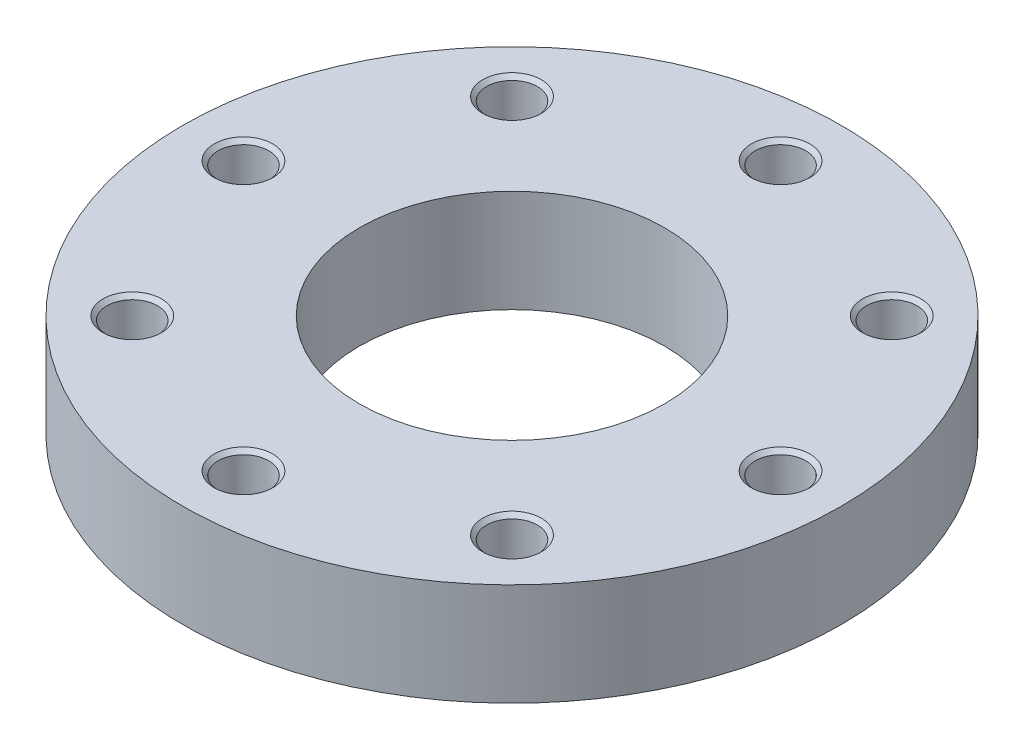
ISO-10303-21;
HEADER;
FILE_DESCRIPTION(('STEP AP214'),'2;1');
FILE_NAME('part.step','',(''),(''),'','','');
FILE_SCHEMA(('AUTOMOTIVE_DESIGN { 1 0 10303 214 1 1 1 1 }'));
ENDSEC;
DATA;
#1=APPLICATION_CONTEXT('core data for automotive mechanical design processes');
#2=APPLICATION_PROTOCOL_DEFINITION('international standard','automotive_design',2000,#1);
#3=PRODUCT_CONTEXT('',#1,'mechanical');
#4=PRODUCT('Part','Part','',(#3));
#5=PRODUCT_RELATED_PRODUCT_CATEGORY('part','',(#4));
#6=PRODUCT_DEFINITION_FORMATION('','',#4);
#7=PRODUCT_DEFINITION_CONTEXT('part definition',#1,'design');
#8=PRODUCT_DEFINITION('design','',#6,#7);
#9=PRODUCT_DEFINITION_SHAPE('','',#8);
#10=(LENGTH_UNIT() NAMED_UNIT(*) SI_UNIT(.MILLI.,.METRE.));
#11=(NAMED_UNIT(*) PLANE_ANGLE_UNIT() SI_UNIT($,.RADIAN.));
#12=(NAMED_UNIT(*) SI_UNIT($,.STERADIAN.) SOLID_ANGLE_UNIT());
#13=UNCERTAINTY_MEASURE_WITH_UNIT(LENGTH_MEASURE(1.E-05),#10,'distance_accuracy_value','');
#14=(GEOMETRIC_REPRESENTATION_CONTEXT(3) GLOBAL_UNCERTAINTY_ASSIGNED_CONTEXT((#13)) GLOBAL_UNIT_ASSIGNED_CONTEXT((#10,
#11,#12)) REPRESENTATION_CONTEXT('',''));
#15=CARTESIAN_POINT('',(0.,0.,0.));
#16=DIRECTION('',(0.,0.,1.));
#17=DIRECTION('',(1.,0.,0.));
#18=AXIS2_PLACEMENT_3D('',#15,#16,#17);
#19=CARTESIAN_POINT('',(0.,21.,0.));
#20=DIRECTION('',(0.,-1.,0.));
#21=DIRECTION('',(1.,0.,0.));
#22=AXIS2_PLACEMENT_3D('',#19,#20,#21);
#23=CYLINDRICAL_SURFACE('',#22,135.);
#24=CARTESIAN_POINT('',(0.,0.,0.));
#25=DIRECTION('',(0.,1.,0.));
#26=DIRECTION('',(1.,0.,0.));
#27=AXIS2_PLACEMENT_3D('',#24,#25,#26);
#28=CIRCLE('',#27,135.);
#29=CARTESIAN_POINT('',(135.,0.,0.));
#30=VERTEX_POINT('',#29);
#31=EDGE_CURVE('E9',#30,#30,#28,.T.);
#32=ORIENTED_EDGE('',*,*,#31,.T.);
#33=EDGE_LOOP('',(#32));
#34=FACE_BOUND('',#33,.T.);
#35=CARTESIAN_POINT('',(0.,42.,0.));
#36=DIRECTION('',(0.,1.,0.));
#37=DIRECTION('',(1.,0.,0.));
#38=AXIS2_PLACEMENT_3D('',#35,#36,#37);
#39=CIRCLE('',#38,135.);
#40=CARTESIAN_POINT('',(135.,42.,0.));
#41=VERTEX_POINT('',#40);
#42=EDGE_CURVE('E254',#41,#41,#39,.T.);
#43=ORIENTED_EDGE('',*,*,#42,.F.);
#44=EDGE_LOOP('',(#43));
#45=FACE_BOUND('',#44,.T.);
#46=ADVANCED_FACE('F15',(#34,#45),#23,.T.);
#47=CARTESIAN_POINT('',(98.75,0.,0.));
#48=DIRECTION('',(0.,-1.,0.));
#49=DIRECTION('',(-1.,0.,0.));
#50=AXIS2_PLACEMENT_3D('',#47,#48,#49);
#51=PLANE('',#50);
#52=CARTESIAN_POINT('',(0.,0.,0.));
#53=DIRECTION('',(0.,1.,0.));
#54=DIRECTION('',(1.,0.,0.));
#55=AXIS2_PLACEMENT_3D('',#52,#53,#54);
#56=CIRCLE('',#55,62.5);
#57=CARTESIAN_POINT('',(62.5,0.,0.));
#58=VERTEX_POINT('',#57);
#59=EDGE_CURVE('E25',#58,#58,#56,.T.);
#60=ORIENTED_EDGE('',*,*,#59,.T.);
#61=EDGE_LOOP('',(#60));
#62=FACE_BOUND('',#61,.T.);
#63=ORIENTED_EDGE('',*,*,#31,.F.);
#64=EDGE_LOOP('',(#63));
#65=FACE_BOUND('',#64,.T.);
#66=ADVANCED_FACE('F361',(#62,#65),#51,.T.);
#67=CARTESIAN_POINT('',(0.,21.,0.));
#68=DIRECTION('',(0.,-1.,0.));
#69=DIRECTION('',(1.,0.,0.));
#70=AXIS2_PLACEMENT_3D('',#67,#68,#69);
#71=CYLINDRICAL_SURFACE('',#70,62.5);
#72=CARTESIAN_POINT('',(0.,42.,0.));
#73=DIRECTION('',(0.,1.,0.));
#74=DIRECTION('',(1.,0.,0.));
#75=AXIS2_PLACEMENT_3D('',#72,#73,#74);
#76=CIRCLE('',#75,62.5);
#77=CARTESIAN_POINT('',(62.5,42.,0.));
#78=VERTEX_POINT('',#77);
#79=EDGE_CURVE('E282',#78,#78,#76,.T.);
#80=ORIENTED_EDGE('',*,*,#79,.T.);
#81=EDGE_LOOP('',(#80));
#82=FACE_BOUND('',#81,.T.);
#83=ORIENTED_EDGE('',*,*,#59,.F.);
#84=EDGE_LOOP('',(#83));
#85=FACE_BOUND('',#84,.T.);
#86=ADVANCED_FACE('F366',(#82,#85),#71,.F.);
#87=CARTESIAN_POINT('',(98.75,42.,0.));
#88=DIRECTION('',(0.,1.,0.));
#89=DIRECTION('',(1.,0.,0.));
#90=AXIS2_PLACEMENT_3D('',#87,#88,#89);
#91=PLANE('',#90);
#92=ORIENTED_EDGE('',*,*,#42,.T.);
#93=EDGE_LOOP('',(#92));
#94=FACE_BOUND('',#93,.T.);
#95=ORIENTED_EDGE('',*,*,#79,.F.);
#96=EDGE_LOOP('',(#95));
#97=FACE_BOUND('',#96,.T.);
#98=CARTESIAN_POINT('',(110.,42.,0.));
#99=DIRECTION('',(0.,-1.,0.));
#100=DIRECTION('',(1.,0.,0.));
#101=AXIS2_PLACEMENT_3D('',#98,#99,#100);
#102=CIRCLE('',#101,12.);
#103=CARTESIAN_POINT('',(122.,42.,0.));
#104=VERTEX_POINT('',#103);
#105=EDGE_CURVE('E203',#104,#104,#102,.T.);
#106=ORIENTED_EDGE('',*,*,#105,.T.);
#107=EDGE_LOOP('',(#106));
#108=FACE_BOUND('',#107,.T.);
#109=CARTESIAN_POINT('',(77.7817459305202,42.,-77.7817459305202));
#110=DIRECTION('',(0.,-1.,0.));
#111=DIRECTION('',(0.707106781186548,0.,-0.707106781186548));
#112=AXIS2_PLACEMENT_3D('',#109,#110,#111);
#113=CIRCLE('',#112,12.);
#114=CARTESIAN_POINT('',(86.2670273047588,42.,-86.2670273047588));
#115=VERTEX_POINT('',#114);
#116=EDGE_CURVE('E257',#115,#115,#113,.T.);
#117=ORIENTED_EDGE('',*,*,#116,.T.);
#118=EDGE_LOOP('',(#117));
#119=FACE_BOUND('',#118,.T.);
#120=CARTESIAN_POINT('',(0.,42.,-110.));
#121=DIRECTION('',(0.,-1.,0.));
#122=DIRECTION('',(0.,0.,-1.));
#123=AXIS2_PLACEMENT_3D('',#120,#121,#122);
#124=CIRCLE('',#123,12.);
#125=CARTESIAN_POINT('',(0.,42.,-122.));
#126=VERTEX_POINT('',#125);
#127=EDGE_CURVE('E211',#126,#126,#124,.T.);
#128=ORIENTED_EDGE('',*,*,#127,.T.);
#129=EDGE_LOOP('',(#128));
#130=FACE_BOUND('',#129,.T.);
#131=CARTESIAN_POINT('',(-77.7817459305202,42.,-77.7817459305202));
#132=DIRECTION('',(0.,-1.,0.));
#133=DIRECTION('',(-0.707106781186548,0.,-0.707106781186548));
#134=AXIS2_PLACEMENT_3D('',#131,#132,#133);
#135=CIRCLE('',#134,12.);
#136=CARTESIAN_POINT('',(-86.2670273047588,42.,-86.2670273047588));
#137=VERTEX_POINT('',#136);
#138=EDGE_CURVE('E180',#137,#137,#135,.T.);
#139=ORIENTED_EDGE('',*,*,#138,.T.);
#140=EDGE_LOOP('',(#139));
#141=FACE_BOUND('',#140,.T.);
#142=CARTESIAN_POINT('',(-110.,42.,0.));
#143=DIRECTION('',(0.,-1.,0.));
#144=DIRECTION('',(-1.,0.,0.));
#145=AXIS2_PLACEMENT_3D('',#142,#143,#144);
#146=CIRCLE('',#145,12.);
#147=CARTESIAN_POINT('',(-122.,42.,0.));
#148=VERTEX_POINT('',#147);
#149=EDGE_CURVE('E198',#148,#148,#146,.T.);
#150=ORIENTED_EDGE('',*,*,#149,.T.);
#151=EDGE_LOOP('',(#150));
#152=FACE_BOUND('',#151,.T.);
#153=CARTESIAN_POINT('',(-77.7817459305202,42.,77.7817459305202));
#154=DIRECTION('',(0.,-1.,0.));
#155=DIRECTION('',(-0.707106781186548,0.,0.707106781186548));
#156=AXIS2_PLACEMENT_3D('',#153,#154,#155);
#157=CIRCLE('',#156,12.);
#158=CARTESIAN_POINT('',(-86.2670273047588,42.,86.2670273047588));
#159=VERTEX_POINT('',#158);
#160=EDGE_CURVE('E271',#159,#159,#157,.T.);
#161=ORIENTED_EDGE('',*,*,#160,.T.);
#162=EDGE_LOOP('',(#161));
#163=FACE_BOUND('',#162,.T.);
#164=CARTESIAN_POINT('',(0.,42.,110.));
#165=DIRECTION('',(0.,-1.,0.));
#166=DIRECTION('',(0.,0.,1.));
#167=AXIS2_PLACEMENT_3D('',#164,#165,#166);
#168=CIRCLE('',#167,12.);
#169=CARTESIAN_POINT('',(0.,42.,122.));
#170=VERTEX_POINT('',#169);
#171=EDGE_CURVE('E200',#170,#170,#168,.T.);
#172=ORIENTED_EDGE('',*,*,#171,.T.);
#173=EDGE_LOOP('',(#172));
#174=FACE_BOUND('',#173,.T.);
#175=CARTESIAN_POINT('',(77.7817459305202,42.,77.7817459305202));
#176=DIRECTION('',(0.,-1.,0.));
#177=DIRECTION('',(0.707106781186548,0.,0.707106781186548));
#178=AXIS2_PLACEMENT_3D('',#175,#176,#177);
#179=CIRCLE('',#178,12.);
#180=CARTESIAN_POINT('',(86.2670273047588,42.,86.2670273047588));
#181=VERTEX_POINT('',#180);
#182=EDGE_CURVE('E250',#181,#181,#179,.T.);
#183=ORIENTED_EDGE('',*,*,#182,.T.);
#184=EDGE_LOOP('',(#183));
#185=FACE_BOUND('',#184,.T.);
#186=ADVANCED_FACE('F428',(#94,#97,#108,#119,#130,#141,#152,#163,#174,#185),#91,.T.);
#187=CARTESIAN_POINT('',(110.,6.00463463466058,0.));
#188=DIRECTION('',(0.,1.,0.));
#189=DIRECTION('',(1.,0.,0.));
#190=AXIS2_PLACEMENT_3D('',#187,#188,#189);
#191=CONICAL_SURFACE('',#190,5.188125,1.0471975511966);
#192=CARTESIAN_POINT('',(110.,9.,0.));
#193=DIRECTION('',(0.,-1.,0.));
#194=DIRECTION('',(1.,0.,0.));
#195=AXIS2_PLACEMENT_3D('',#192,#193,#194);
#196=CIRCLE('',#195,10.37625);
#197=CARTESIAN_POINT('',(120.37625,9.,0.));
#198=VERTEX_POINT('',#197);
#199=EDGE_CURVE('E19',#198,#198,#196,.T.);
#200=ORIENTED_EDGE('',*,*,#199,.F.);
#201=EDGE_LOOP('',(#200));
#202=FACE_BOUND('',#201,.T.);
#203=CARTESIAN_POINT('',(110.,3.00926926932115,0.));
#204=VERTEX_POINT('',#203);
#205=VERTEX_LOOP('',#204);
#206=FACE_BOUND('',#205,.T.);
#207=ADVANCED_FACE('F462',(#202,#206),#191,.F.);
#208=CARTESIAN_POINT('',(110.,12.688125,0.));
#209=DIRECTION('',(0.,1.,0.));
#210=DIRECTION('',(1.,0.,0.));
#211=AXIS2_PLACEMENT_3D('',#208,#209,#210);
#212=CYLINDRICAL_SURFACE('',#211,10.37625);
#213=CARTESIAN_POINT('',(110.,16.37625,0.));
#214=DIRECTION('',(0.,-1.,0.));
#215=DIRECTION('',(1.,0.,0.));
#216=AXIS2_PLACEMENT_3D('',#213,#214,#215);
#217=CIRCLE('',#216,10.37625);
#218=CARTESIAN_POINT('',(120.37625,16.37625,0.));
#219=VERTEX_POINT('',#218);
#220=EDGE_CURVE('E192',#219,#219,#217,.T.);
#221=ORIENTED_EDGE('',*,*,#220,.F.);
#222=EDGE_LOOP('',(#221));
#223=FACE_BOUND('',#222,.T.);
#224=ORIENTED_EDGE('',*,*,#199,.T.);
#225=EDGE_LOOP('',(#224));
#226=FACE_BOUND('',#225,.T.);
#227=ADVANCED_FACE('F460',(#223,#226),#212,.F.);
#228=CARTESIAN_POINT('',(110.,17.188125,0.));
#229=DIRECTION('',(0.,1.,0.));
#230=DIRECTION('',(1.,0.,0.));
#231=AXIS2_PLACEMENT_3D('',#228,#229,#230);
#232=CONICAL_SURFACE('',#231,11.188125,0.785398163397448);
#233=CARTESIAN_POINT('',(110.,18.,0.));
#234=DIRECTION('',(0.,-1.,0.));
#235=DIRECTION('',(1.,0.,0.));
#236=AXIS2_PLACEMENT_3D('',#233,#234,#235);
#237=CIRCLE('',#236,12.);
#238=CARTESIAN_POINT('',(122.,18.,0.));
#239=VERTEX_POINT('',#238);
#240=EDGE_CURVE('E194',#239,#239,#237,.T.);
#241=ORIENTED_EDGE('',*,*,#240,.F.);
#242=EDGE_LOOP('',(#241));
#243=FACE_BOUND('',#242,.T.);
#244=ORIENTED_EDGE('',*,*,#220,.T.);
#245=EDGE_LOOP('',(#244));
#246=FACE_BOUND('',#245,.T.);
#247=ADVANCED_FACE('F394',(#243,#246),#232,.F.);
#248=CARTESIAN_POINT('',(121.188125,18.,0.));
#249=DIRECTION('',(0.,1.,0.));
#250=DIRECTION('',(-1.,0.,0.));
#251=AXIS2_PLACEMENT_3D('',#248,#249,#250);
#252=PLANE('',#251);
#253=CARTESIAN_POINT('',(110.,18.,0.));
#254=DIRECTION('',(0.,-1.,0.));
#255=DIRECTION('',(1.,0.,0.));
#256=AXIS2_PLACEMENT_3D('',#253,#254,#255);
#257=CIRCLE('',#256,10.37625);
#258=CARTESIAN_POINT('',(120.37625,18.,0.));
#259=VERTEX_POINT('',#258);
#260=EDGE_CURVE('E206',#259,#259,#257,.T.);
#261=ORIENTED_EDGE('',*,*,#260,.F.);
#262=EDGE_LOOP('',(#261));
#263=FACE_BOUND('',#262,.T.);
#264=ORIENTED_EDGE('',*,*,#240,.T.);
#265=EDGE_LOOP('',(#264));
#266=FACE_BOUND('',#265,.T.);
#267=ADVANCED_FACE('F390',(#263,#266),#252,.F.);
#268=CARTESIAN_POINT('',(110.,29.188125,0.));
#269=DIRECTION('',(0.,1.,0.));
#270=DIRECTION('',(1.,0.,0.));
#271=AXIS2_PLACEMENT_3D('',#268,#269,#270);
#272=CYLINDRICAL_SURFACE('',#271,10.37625);
#273=CARTESIAN_POINT('',(110.,40.37625,0.));
#274=DIRECTION('',(0.,-1.,0.));
#275=DIRECTION('',(1.,0.,0.));
#276=AXIS2_PLACEMENT_3D('',#273,#274,#275);
#277=CIRCLE('',#276,10.37625);
#278=CARTESIAN_POINT('',(120.37625,40.37625,0.));
#279=VERTEX_POINT('',#278);
#280=EDGE_CURVE('E207',#279,#279,#277,.T.);
#281=ORIENTED_EDGE('',*,*,#280,.F.);
#282=EDGE_LOOP('',(#281));
#283=FACE_BOUND('',#282,.T.);
#284=ORIENTED_EDGE('',*,*,#260,.T.);
#285=EDGE_LOOP('',(#284));
#286=FACE_BOUND('',#285,.T.);
#287=ADVANCED_FACE('F393',(#283,#286),#272,.F.);
#288=CARTESIAN_POINT('',(110.,41.188125,0.));
#289=DIRECTION('',(0.,1.,0.));
#290=DIRECTION('',(1.,0.,0.));
#291=AXIS2_PLACEMENT_3D('',#288,#289,#290);
#292=CONICAL_SURFACE('',#291,11.188125,0.785398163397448);
#293=ORIENTED_EDGE('',*,*,#105,.F.);
#294=EDGE_LOOP('',(#293));
#295=FACE_BOUND('',#294,.T.);
#296=ORIENTED_EDGE('',*,*,#280,.T.);
#297=EDGE_LOOP('',(#296));
#298=FACE_BOUND('',#297,.T.);
#299=ADVANCED_FACE('F483',(#295,#298),#292,.F.);
#300=CARTESIAN_POINT('',(77.7817459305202,6.00463463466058,-77.7817459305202));
#301=DIRECTION('',(0.,1.,0.));
#302=DIRECTION('',(0.707106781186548,0.,-0.707106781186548));
#303=AXIS2_PLACEMENT_3D('',#300,#301,#302);
#304=CONICAL_SURFACE('',#303,5.188125,1.0471975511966);
#305=CARTESIAN_POINT('',(77.7817459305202,9.,-77.7817459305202));
#306=DIRECTION('',(0.,-1.,0.));
#307=DIRECTION('',(0.707106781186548,0.,-0.707106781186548));
#308=AXIS2_PLACEMENT_3D('',#305,#306,#307);
#309=CIRCLE('',#308,10.37625);
#310=CARTESIAN_POINT('',(85.1188626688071,9.,-85.1188626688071));
#311=VERTEX_POINT('',#310);
#312=EDGE_CURVE('E237',#311,#311,#309,.T.);
#313=ORIENTED_EDGE('',*,*,#312,.F.);
#314=EDGE_LOOP('',(#313));
#315=FACE_BOUND('',#314,.T.);
#316=CARTESIAN_POINT('',(77.7817459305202,3.00926926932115,-77.7817459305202));
#317=VERTEX_POINT('',#316);
#318=VERTEX_LOOP('',#317);
#319=FACE_BOUND('',#318,.T.);
#320=ADVANCED_FACE('F480',(#315,#319),#304,.F.);
#321=CARTESIAN_POINT('',(77.7817459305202,12.688125,-77.7817459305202));
#322=DIRECTION('',(0.,1.,0.));
#323=DIRECTION('',(0.707106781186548,0.,-0.707106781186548));
#324=AXIS2_PLACEMENT_3D('',#321,#322,#323);
#325=CYLINDRICAL_SURFACE('',#324,10.37625);
#326=CARTESIAN_POINT('',(77.7817459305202,16.37625,-77.7817459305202));
#327=DIRECTION('',(0.,-1.,0.));
#328=DIRECTION('',(0.707106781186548,0.,-0.707106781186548));
#329=AXIS2_PLACEMENT_3D('',#326,#327,#328);
#330=CIRCLE('',#329,10.37625);
#331=CARTESIAN_POINT('',(85.1188626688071,16.37625,-85.1188626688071));
#332=VERTEX_POINT('',#331);
#333=EDGE_CURVE('E238',#332,#332,#330,.T.);
#334=ORIENTED_EDGE('',*,*,#333,.F.);
#335=EDGE_LOOP('',(#334));
#336=FACE_BOUND('',#335,.T.);
#337=ORIENTED_EDGE('',*,*,#312,.T.);
#338=EDGE_LOOP('',(#337));
#339=FACE_BOUND('',#338,.T.);
#340=ADVANCED_FACE('F17',(#336,#339),#325,.F.);
#341=CARTESIAN_POINT('',(77.7817459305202,17.188125,-77.7817459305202));
#342=DIRECTION('',(0.,1.,0.));
#343=DIRECTION('',(0.707106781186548,0.,-0.707106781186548));
#344=AXIS2_PLACEMENT_3D('',#341,#342,#343);
#345=CONICAL_SURFACE('',#344,11.188125,0.785398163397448);
#346=CARTESIAN_POINT('',(77.7817459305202,18.,-77.7817459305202));
#347=DIRECTION('',(0.,-1.,0.));
#348=DIRECTION('',(0.707106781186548,0.,-0.707106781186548));
#349=AXIS2_PLACEMENT_3D('',#346,#347,#348);
#350=CIRCLE('',#349,12.);
#351=CARTESIAN_POINT('',(86.2670273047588,18.,-86.2670273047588));
#352=VERTEX_POINT('',#351);
#353=EDGE_CURVE('E243',#352,#352,#350,.T.);
#354=ORIENTED_EDGE('',*,*,#353,.F.);
#355=EDGE_LOOP('',(#354));
#356=FACE_BOUND('',#355,.T.);
#357=ORIENTED_EDGE('',*,*,#333,.T.);
#358=EDGE_LOOP('',(#357));
#359=FACE_BOUND('',#358,.T.);
#360=ADVANCED_FACE('F485',(#356,#359),#345,.F.);
#361=CARTESIAN_POINT('',(85.692944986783,18.,-85.692944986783));
#362=DIRECTION('',(0.,1.,0.));
#363=DIRECTION('',(-0.707106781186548,0.,0.707106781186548));
#364=AXIS2_PLACEMENT_3D('',#361,#362,#363);
#365=PLANE('',#364);
#366=CARTESIAN_POINT('',(77.7817459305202,18.,-77.7817459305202));
#367=DIRECTION('',(0.,-1.,0.));
#368=DIRECTION('',(0.707106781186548,0.,-0.707106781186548));
#369=AXIS2_PLACEMENT_3D('',#366,#367,#368);
#370=CIRCLE('',#369,10.37625);
#371=CARTESIAN_POINT('',(85.1188626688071,18.,-85.1188626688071));
#372=VERTEX_POINT('',#371);
#373=EDGE_CURVE('E247',#372,#372,#370,.T.);
#374=ORIENTED_EDGE('',*,*,#373,.F.);
#375=EDGE_LOOP('',(#374));
#376=FACE_BOUND('',#375,.T.);
#377=ORIENTED_EDGE('',*,*,#353,.T.);
#378=EDGE_LOOP('',(#377));
#379=FACE_BOUND('',#378,.T.);
#380=ADVANCED_FACE('F488',(#376,#379),#365,.F.);
#381=CARTESIAN_POINT('',(77.7817459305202,29.188125,-77.7817459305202));
#382=DIRECTION('',(0.,1.,0.));
#383=DIRECTION('',(0.707106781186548,0.,-0.707106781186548));
#384=AXIS2_PLACEMENT_3D('',#381,#382,#383);
#385=CYLINDRICAL_SURFACE('',#384,10.37625);
#386=CARTESIAN_POINT('',(77.7817459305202,40.37625,-77.7817459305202));
#387=DIRECTION('',(0.,-1.,0.));
#388=DIRECTION('',(0.707106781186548,0.,-0.707106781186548));
#389=AXIS2_PLACEMENT_3D('',#386,#387,#388);
#390=CIRCLE('',#389,10.37625);
#391=CARTESIAN_POINT('',(85.1188626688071,40.37625,-85.1188626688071));
#392=VERTEX_POINT('',#391);
#393=EDGE_CURVE('E190',#392,#392,#390,.T.);
#394=ORIENTED_EDGE('',*,*,#393,.F.);
#395=EDGE_LOOP('',(#394));
#396=FACE_BOUND('',#395,.T.);
#397=ORIENTED_EDGE('',*,*,#373,.T.);
#398=EDGE_LOOP('',(#397));
#399=FACE_BOUND('',#398,.T.);
#400=ADVANCED_FACE('F435',(#396,#399),#385,.F.);
#401=CARTESIAN_POINT('',(77.7817459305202,41.188125,-77.7817459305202));
#402=DIRECTION('',(0.,1.,0.));
#403=DIRECTION('',(0.707106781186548,0.,-0.707106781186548));
#404=AXIS2_PLACEMENT_3D('',#401,#402,#403);
#405=CONICAL_SURFACE('',#404,11.188125,0.785398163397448);
#406=ORIENTED_EDGE('',*,*,#116,.F.);
#407=EDGE_LOOP('',(#406));
#408=FACE_BOUND('',#407,.T.);
#409=ORIENTED_EDGE('',*,*,#393,.T.);
#410=EDGE_LOOP('',(#409));
#411=FACE_BOUND('',#410,.T.);
#412=ADVANCED_FACE('F431',(#408,#411),#405,.F.);
#413=CARTESIAN_POINT('',(0.,6.00463463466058,-110.));
#414=DIRECTION('',(0.,1.,0.));
#415=DIRECTION('',(0.,0.,-1.));
#416=AXIS2_PLACEMENT_3D('',#413,#414,#415);
#417=CONICAL_SURFACE('',#416,5.188125,1.0471975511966);
#418=CARTESIAN_POINT('',(0.,9.,-110.));
#419=DIRECTION('',(0.,-1.,0.));
#420=DIRECTION('',(0.,0.,-1.));
#421=AXIS2_PLACEMENT_3D('',#418,#419,#420);
#422=CIRCLE('',#421,10.37625);
#423=CARTESIAN_POINT('',(0.,9.,-120.37625));
#424=VERTEX_POINT('',#423);
#425=EDGE_CURVE('E187',#424,#424,#422,.T.);
#426=ORIENTED_EDGE('',*,*,#425,.F.);
#427=EDGE_LOOP('',(#426));
#428=FACE_BOUND('',#427,.T.);
#429=CARTESIAN_POINT('',(0.,3.00926926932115,-110.));
#430=VERTEX_POINT('',#429);
#431=VERTEX_LOOP('',#430);
#432=FACE_BOUND('',#431,.T.);
#433=ADVANCED_FACE('F434',(#428,#432),#417,.F.);
#434=CARTESIAN_POINT('',(0.,12.688125,-110.));
#435=DIRECTION('',(0.,1.,0.));
#436=DIRECTION('',(0.,0.,-1.));
#437=AXIS2_PLACEMENT_3D('',#434,#435,#436);
#438=CYLINDRICAL_SURFACE('',#437,10.37625);
#439=CARTESIAN_POINT('',(0.,16.37625,-110.));
#440=DIRECTION('',(0.,-1.,0.));
#441=DIRECTION('',(0.,0.,-1.));
#442=AXIS2_PLACEMENT_3D('',#439,#440,#441);
#443=CIRCLE('',#442,10.37625);
#444=CARTESIAN_POINT('',(0.,16.37625,-120.37625));
#445=VERTEX_POINT('',#444);
#446=EDGE_CURVE('E191',#445,#445,#443,.T.);
#447=ORIENTED_EDGE('',*,*,#446,.F.);
#448=EDGE_LOOP('',(#447));
#449=FACE_BOUND('',#448,.T.);
#450=ORIENTED_EDGE('',*,*,#425,.T.);
#451=EDGE_LOOP('',(#450));
#452=FACE_BOUND('',#451,.T.);
#453=ADVANCED_FACE('F446',(#449,#452),#438,.F.);
#454=CARTESIAN_POINT('',(0.,17.188125,-110.));
#455=DIRECTION('',(0.,1.,0.));
#456=DIRECTION('',(0.,0.,-1.));
#457=AXIS2_PLACEMENT_3D('',#454,#455,#456);
#458=CONICAL_SURFACE('',#457,11.188125,0.785398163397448);
#459=CARTESIAN_POINT('',(0.,18.,-110.));
#460=DIRECTION('',(0.,-1.,0.));
#461=DIRECTION('',(0.,0.,-1.));
#462=AXIS2_PLACEMENT_3D('',#459,#460,#461);
#463=CIRCLE('',#462,12.);
#464=CARTESIAN_POINT('',(0.,18.,-122.));
#465=VERTEX_POINT('',#464);
#466=EDGE_CURVE('E210',#465,#465,#463,.T.);
#467=ORIENTED_EDGE('',*,*,#466,.F.);
#468=EDGE_LOOP('',(#467));
#469=FACE_BOUND('',#468,.T.);
#470=ORIENTED_EDGE('',*,*,#446,.T.);
#471=EDGE_LOOP('',(#470));
#472=FACE_BOUND('',#471,.T.);
#473=ADVANCED_FACE('F449',(#469,#472),#458,.F.);
#474=CARTESIAN_POINT('',(0.,18.,-121.188125));
#475=DIRECTION('',(0.,1.,0.));
#476=DIRECTION('',(0.,0.,1.));
#477=AXIS2_PLACEMENT_3D('',#474,#475,#476);
#478=PLANE('',#477);
#479=CARTESIAN_POINT('',(0.,18.,-110.));
#480=DIRECTION('',(0.,-1.,0.));
#481=DIRECTION('',(0.,0.,-1.));
#482=AXIS2_PLACEMENT_3D('',#479,#480,#481);
#483=CIRCLE('',#482,10.37625);
#484=CARTESIAN_POINT('',(0.,18.,-120.37625));
#485=VERTEX_POINT('',#484);
#486=EDGE_CURVE('E208',#485,#485,#483,.T.);
#487=ORIENTED_EDGE('',*,*,#486,.F.);
#488=EDGE_LOOP('',(#487));
#489=FACE_BOUND('',#488,.T.);
#490=ORIENTED_EDGE('',*,*,#466,.T.);
#491=EDGE_LOOP('',(#490));
#492=FACE_BOUND('',#491,.T.);
#493=ADVANCED_FACE('F502',(#489,#492),#478,.F.);
#494=CARTESIAN_POINT('',(0.,29.188125,-110.));
#495=DIRECTION('',(0.,1.,0.));
#496=DIRECTION('',(0.,0.,-1.));
#497=AXIS2_PLACEMENT_3D('',#494,#495,#496);
#498=CYLINDRICAL_SURFACE('',#497,10.37625);
#499=CARTESIAN_POINT('',(0.,40.37625,-110.));
#500=DIRECTION('',(0.,-1.,0.));
#501=DIRECTION('',(0.,0.,-1.));
#502=AXIS2_PLACEMENT_3D('',#499,#500,#501);
#503=CIRCLE('',#502,10.37625);
#504=CARTESIAN_POINT('',(0.,40.37625,-120.37625));
#505=VERTEX_POINT('',#504);
#506=EDGE_CURVE('E265',#505,#505,#503,.T.);
#507=ORIENTED_EDGE('',*,*,#506,.F.);
#508=EDGE_LOOP('',(#507));
#509=FACE_BOUND('',#508,.T.);
#510=ORIENTED_EDGE('',*,*,#486,.T.);
#511=EDGE_LOOP('',(#510));
#512=FACE_BOUND('',#511,.T.);
#513=ADVANCED_FACE('F504',(#509,#512),#498,.F.);
#514=CARTESIAN_POINT('',(0.,41.188125,-110.));
#515=DIRECTION('',(0.,1.,0.));
#516=DIRECTION('',(0.,0.,-1.));
#517=AXIS2_PLACEMENT_3D('',#514,#515,#516);
#518=CONICAL_SURFACE('',#517,11.188125,0.785398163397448);
#519=ORIENTED_EDGE('',*,*,#127,.F.);
#520=EDGE_LOOP('',(#519));
#521=FACE_BOUND('',#520,.T.);
#522=ORIENTED_EDGE('',*,*,#506,.T.);
#523=EDGE_LOOP('',(#522));
#524=FACE_BOUND('',#523,.T.);
#525=ADVANCED_FACE('F316',(#521,#524),#518,.F.);
#526=CARTESIAN_POINT('',(-77.7817459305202,6.00463463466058,-77.7817459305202));
#527=DIRECTION('',(0.,1.,0.));
#528=DIRECTION('',(-0.707106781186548,0.,-0.707106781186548));
#529=AXIS2_PLACEMENT_3D('',#526,#527,#528);
#530=CONICAL_SURFACE('',#529,5.188125,1.0471975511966);
#531=CARTESIAN_POINT('',(-77.7817459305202,9.,-77.7817459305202));
#532=DIRECTION('',(0.,-1.,0.));
#533=DIRECTION('',(-0.707106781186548,0.,-0.707106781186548));
#534=AXIS2_PLACEMENT_3D('',#531,#532,#533);
#535=CIRCLE('',#534,10.37625);
#536=CARTESIAN_POINT('',(-85.1188626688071,9.,-85.1188626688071));
#537=VERTEX_POINT('',#536);
#538=EDGE_CURVE('E267',#537,#537,#535,.T.);
#539=ORIENTED_EDGE('',*,*,#538,.F.);
#540=EDGE_LOOP('',(#539));
#541=FACE_BOUND('',#540,.T.);
#542=CARTESIAN_POINT('',(-77.7817459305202,3.00926926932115,-77.7817459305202));
#543=VERTEX_POINT('',#542);
#544=VERTEX_LOOP('',#543);
#545=FACE_BOUND('',#544,.T.);
#546=ADVANCED_FACE('F309',(#541,#545),#530,.F.);
#547=CARTESIAN_POINT('',(-77.7817459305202,12.688125,-77.7817459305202));
#548=DIRECTION('',(0.,1.,0.));
#549=DIRECTION('',(-0.707106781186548,0.,-0.707106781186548));
#550=AXIS2_PLACEMENT_3D('',#547,#548,#549);
#551=CYLINDRICAL_SURFACE('',#550,10.37625);
#552=CARTESIAN_POINT('',(-77.7817459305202,16.37625,-77.7817459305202));
#553=DIRECTION('',(0.,-1.,0.));
#554=DIRECTION('',(-0.707106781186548,0.,-0.707106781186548));
#555=AXIS2_PLACEMENT_3D('',#552,#553,#554);
#556=CIRCLE('',#555,10.37625);
#557=CARTESIAN_POINT('',(-85.1188626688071,16.37625,-85.1188626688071));
#558=VERTEX_POINT('',#557);
#559=EDGE_CURVE('E275',#558,#558,#556,.T.);
#560=ORIENTED_EDGE('',*,*,#559,.F.);
#561=EDGE_LOOP('',(#560));
#562=FACE_BOUND('',#561,.T.);
#563=ORIENTED_EDGE('',*,*,#538,.T.);
#564=EDGE_LOOP('',(#563));
#565=FACE_BOUND('',#564,.T.);
#566=ADVANCED_FACE('F302',(#562,#565),#551,.F.);
#567=CARTESIAN_POINT('',(-77.7817459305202,17.188125,-77.7817459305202));
#568=DIRECTION('',(0.,1.,0.));
#569=DIRECTION('',(-0.707106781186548,0.,-0.707106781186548));
#570=AXIS2_PLACEMENT_3D('',#567,#568,#569);
#571=CONICAL_SURFACE('',#570,11.188125,0.785398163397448);
#572=CARTESIAN_POINT('',(-77.7817459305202,18.,-77.7817459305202));
#573=DIRECTION('',(0.,-1.,0.));
#574=DIRECTION('',(-0.707106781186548,0.,-0.707106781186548));
#575=AXIS2_PLACEMENT_3D('',#572,#573,#574);
#576=CIRCLE('',#575,12.);
#577=CARTESIAN_POINT('',(-86.2670273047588,18.,-86.2670273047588));
#578=VERTEX_POINT('',#577);
#579=EDGE_CURVE('E185',#578,#578,#576,.T.);
#580=ORIENTED_EDGE('',*,*,#579,.F.);
#581=EDGE_LOOP('',(#580));
#582=FACE_BOUND('',#581,.T.);
#583=ORIENTED_EDGE('',*,*,#559,.T.);
#584=EDGE_LOOP('',(#583));
#585=FACE_BOUND('',#584,.T.);
#586=ADVANCED_FACE('F299',(#582,#585),#571,.F.);
#587=CARTESIAN_POINT('',(-85.692944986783,18.,-85.692944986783));
#588=DIRECTION('',(0.,1.,0.));
#589=DIRECTION('',(0.707106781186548,0.,0.707106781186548));
#590=AXIS2_PLACEMENT_3D('',#587,#588,#589);
#591=PLANE('',#590);
#592=CARTESIAN_POINT('',(-77.7817459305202,18.,-77.7817459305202));
#593=DIRECTION('',(0.,-1.,0.));
#594=DIRECTION('',(-0.707106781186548,0.,-0.707106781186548));
#595=AXIS2_PLACEMENT_3D('',#592,#593,#594);
#596=CIRCLE('',#595,10.37625);
#597=CARTESIAN_POINT('',(-85.1188626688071,18.,-85.1188626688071));
#598=VERTEX_POINT('',#597);
#599=EDGE_CURVE('E291',#598,#598,#596,.T.);
#600=ORIENTED_EDGE('',*,*,#599,.F.);
#601=EDGE_LOOP('',(#600));
#602=FACE_BOUND('',#601,.T.);
#603=ORIENTED_EDGE('',*,*,#579,.T.);
#604=EDGE_LOOP('',(#603));
#605=FACE_BOUND('',#604,.T.);
#606=ADVANCED_FACE('F297',(#602,#605),#591,.F.);
#607=CARTESIAN_POINT('',(-77.7817459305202,29.188125,-77.7817459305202));
#608=DIRECTION('',(0.,1.,0.));
#609=DIRECTION('',(-0.707106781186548,0.,-0.707106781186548));
#610=AXIS2_PLACEMENT_3D('',#607,#608,#609);
#611=CYLINDRICAL_SURFACE('',#610,10.37625);
#612=CARTESIAN_POINT('',(-77.7817459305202,40.37625,-77.7817459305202));
#613=DIRECTION('',(0.,-1.,0.));
#614=DIRECTION('',(-0.707106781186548,0.,-0.707106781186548));
#615=AXIS2_PLACEMENT_3D('',#612,#613,#614);
#616=CIRCLE('',#615,10.37625);
#617=CARTESIAN_POINT('',(-85.1188626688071,40.37625,-85.1188626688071));
#618=VERTEX_POINT('',#617);
#619=EDGE_CURVE('E177',#618,#618,#616,.T.);
#620=ORIENTED_EDGE('',*,*,#619,.F.);
#621=EDGE_LOOP('',(#620));
#622=FACE_BOUND('',#621,.T.);
#623=ORIENTED_EDGE('',*,*,#599,.T.);
#624=EDGE_LOOP('',(#623));
#625=FACE_BOUND('',#624,.T.);
#626=ADVANCED_FACE('F388',(#622,#625),#611,.F.);
#627=CARTESIAN_POINT('',(-77.7817459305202,41.188125,-77.7817459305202));
#628=DIRECTION('',(0.,1.,0.));
#629=DIRECTION('',(-0.707106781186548,0.,-0.707106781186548));
#630=AXIS2_PLACEMENT_3D('',#627,#628,#629);
#631=CONICAL_SURFACE('',#630,11.188125,0.785398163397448);
#632=ORIENTED_EDGE('',*,*,#138,.F.);
#633=EDGE_LOOP('',(#632));
#634=FACE_BOUND('',#633,.T.);
#635=ORIENTED_EDGE('',*,*,#619,.T.);
#636=EDGE_LOOP('',(#635));
#637=FACE_BOUND('',#636,.T.);
#638=ADVANCED_FACE('F445',(#634,#637),#631,.F.);
#639=CARTESIAN_POINT('',(-110.,6.00463463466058,0.));
#640=DIRECTION('',(0.,1.,0.));
#641=DIRECTION('',(-1.,0.,0.));
#642=AXIS2_PLACEMENT_3D('',#639,#640,#641);
#643=CONICAL_SURFACE('',#642,5.188125,1.0471975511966);
#644=CARTESIAN_POINT('',(-110.,9.,0.));
#645=DIRECTION('',(0.,-1.,0.));
#646=DIRECTION('',(-1.,0.,0.));
#647=AXIS2_PLACEMENT_3D('',#644,#645,#646);
#648=CIRCLE('',#647,10.37625);
#649=CARTESIAN_POINT('',(-120.37625,9.,0.));
#650=VERTEX_POINT('',#649);
#651=EDGE_CURVE('E174',#650,#650,#648,.T.);
#652=ORIENTED_EDGE('',*,*,#651,.F.);
#653=EDGE_LOOP('',(#652));
#654=FACE_BOUND('',#653,.T.);
#655=CARTESIAN_POINT('',(-110.,3.00926926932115,0.));
#656=VERTEX_POINT('',#655);
#657=VERTEX_LOOP('',#656);
#658=FACE_BOUND('',#657,.T.);
#659=ADVANCED_FACE('F442',(#654,#658),#643,.F.);
#660=CARTESIAN_POINT('',(-110.,12.688125,0.));
#661=DIRECTION('',(0.,1.,0.));
#662=DIRECTION('',(-1.,0.,0.));
#663=AXIS2_PLACEMENT_3D('',#660,#661,#662);
#664=CYLINDRICAL_SURFACE('',#663,10.37625);
#665=CARTESIAN_POINT('',(-110.,16.37625,0.));
#666=DIRECTION('',(0.,-1.,0.));
#667=DIRECTION('',(-1.,0.,0.));
#668=AXIS2_PLACEMENT_3D('',#665,#666,#667);
#669=CIRCLE('',#668,10.37625);
#670=CARTESIAN_POINT('',(-120.37625,16.37625,0.));
#671=VERTEX_POINT('',#670);
#672=EDGE_CURVE('E178',#671,#671,#669,.T.);
#673=ORIENTED_EDGE('',*,*,#672,.F.);
#674=EDGE_LOOP('',(#673));
#675=FACE_BOUND('',#674,.T.);
#676=ORIENTED_EDGE('',*,*,#651,.T.);
#677=EDGE_LOOP('',(#676));
#678=FACE_BOUND('',#677,.T.);
#679=ADVANCED_FACE('F175',(#675,#678),#664,.F.);
#680=CARTESIAN_POINT('',(-110.,17.188125,0.));
#681=DIRECTION('',(0.,1.,0.));
#682=DIRECTION('',(-1.,0.,0.));
#683=AXIS2_PLACEMENT_3D('',#680,#681,#682);
#684=CONICAL_SURFACE('',#683,11.188125,0.785398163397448);
#685=CARTESIAN_POINT('',(-110.,18.,0.));
#686=DIRECTION('',(0.,-1.,0.));
#687=DIRECTION('',(-1.,0.,0.));
#688=AXIS2_PLACEMENT_3D('',#685,#686,#687);
#689=CIRCLE('',#688,12.);
#690=CARTESIAN_POINT('',(-122.,18.,0.));
#691=VERTEX_POINT('',#690);
#692=EDGE_CURVE('E159',#691,#691,#689,.T.);
#693=ORIENTED_EDGE('',*,*,#692,.F.);
#694=EDGE_LOOP('',(#693));
#695=FACE_BOUND('',#694,.T.);
#696=ORIENTED_EDGE('',*,*,#672,.T.);
#697=EDGE_LOOP('',(#696));
#698=FACE_BOUND('',#697,.T.);
#699=ADVANCED_FACE('F437',(#695,#698),#684,.F.);
#700=CARTESIAN_POINT('',(-121.188125,18.,0.));
#701=DIRECTION('',(0.,1.,0.));
#702=DIRECTION('',(1.,0.,0.));
#703=AXIS2_PLACEMENT_3D('',#700,#701,#702);
#704=PLANE('',#703);
#705=CARTESIAN_POINT('',(-110.,18.,0.));
#706=DIRECTION('',(0.,-1.,0.));
#707=DIRECTION('',(-1.,0.,0.));
#708=AXIS2_PLACEMENT_3D('',#705,#706,#707);
#709=CIRCLE('',#708,10.37625);
#710=CARTESIAN_POINT('',(-120.37625,18.,0.));
#711=VERTEX_POINT('',#710);
#712=EDGE_CURVE('E164',#711,#711,#709,.T.);
#713=ORIENTED_EDGE('',*,*,#712,.F.);
#714=EDGE_LOOP('',(#713));
#715=FACE_BOUND('',#714,.T.);
#716=ORIENTED_EDGE('',*,*,#692,.T.);
#717=EDGE_LOOP('',(#716));
#718=FACE_BOUND('',#717,.T.);
#719=ADVANCED_FACE('F440',(#715,#718),#704,.F.);
#720=CARTESIAN_POINT('',(-110.,29.188125,0.));
#721=DIRECTION('',(0.,1.,0.));
#722=DIRECTION('',(-1.,0.,0.));
#723=AXIS2_PLACEMENT_3D('',#720,#721,#722);
#724=CYLINDRICAL_SURFACE('',#723,10.37625);
#725=CARTESIAN_POINT('',(-110.,40.37625,0.));
#726=DIRECTION('',(0.,-1.,0.));
#727=DIRECTION('',(-1.,0.,0.));
#728=AXIS2_PLACEMENT_3D('',#725,#726,#727);
#729=CIRCLE('',#728,10.37625);
#730=CARTESIAN_POINT('',(-120.37625,40.37625,0.));
#731=VERTEX_POINT('',#730);
#732=EDGE_CURVE('E195',#731,#731,#729,.T.);
#733=ORIENTED_EDGE('',*,*,#732,.F.);
#734=EDGE_LOOP('',(#733));
#735=FACE_BOUND('',#734,.T.);
#736=ORIENTED_EDGE('',*,*,#712,.T.);
#737=EDGE_LOOP('',(#736));
#738=FACE_BOUND('',#737,.T.);
#739=ADVANCED_FACE('F455',(#735,#738),#724,.F.);
#740=CARTESIAN_POINT('',(-110.,41.188125,0.));
#741=DIRECTION('',(0.,1.,0.));
#742=DIRECTION('',(-1.,0.,0.));
#743=AXIS2_PLACEMENT_3D('',#740,#741,#742);
#744=CONICAL_SURFACE('',#743,11.188125,0.785398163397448);
#745=ORIENTED_EDGE('',*,*,#149,.F.);
#746=EDGE_LOOP('',(#745));
#747=FACE_BOUND('',#746,.T.);
#748=ORIENTED_EDGE('',*,*,#732,.T.);
#749=EDGE_LOOP('',(#748));
#750=FACE_BOUND('',#749,.T.);
#751=ADVANCED_FACE('F451',(#747,#750),#744,.F.);
#752=CARTESIAN_POINT('',(-77.7817459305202,6.00463463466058,77.7817459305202));
#753=DIRECTION('',(0.,1.,0.));
#754=DIRECTION('',(-0.707106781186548,0.,0.707106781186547));
#755=AXIS2_PLACEMENT_3D('',#752,#753,#754);
#756=CONICAL_SURFACE('',#755,5.188125,1.0471975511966);
#757=CARTESIAN_POINT('',(-77.7817459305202,9.,77.7817459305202));
#758=DIRECTION('',(0.,-1.,0.));
#759=DIRECTION('',(-0.707106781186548,0.,0.707106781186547));
#760=AXIS2_PLACEMENT_3D('',#757,#758,#759);
#761=CIRCLE('',#760,10.37625);
#762=CARTESIAN_POINT('',(-85.1188626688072,9.,85.1188626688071));
#763=VERTEX_POINT('',#762);
#764=EDGE_CURVE('E199',#763,#763,#761,.T.);
#765=ORIENTED_EDGE('',*,*,#764,.F.);
#766=EDGE_LOOP('',(#765));
#767=FACE_BOUND('',#766,.T.);
#768=CARTESIAN_POINT('',(-77.7817459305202,3.00926926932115,77.7817459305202));
#769=VERTEX_POINT('',#768);
#770=VERTEX_LOOP('',#769);
#771=FACE_BOUND('',#770,.T.);
#772=ADVANCED_FACE('F454',(#767,#771),#756,.F.);
#773=CARTESIAN_POINT('',(-77.7817459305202,12.688125,77.7817459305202));
#774=DIRECTION('',(0.,1.,0.));
#775=DIRECTION('',(-0.707106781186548,0.,0.707106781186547));
#776=AXIS2_PLACEMENT_3D('',#773,#774,#775);
#777=CYLINDRICAL_SURFACE('',#776,10.37625);
#778=CARTESIAN_POINT('',(-77.7817459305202,16.37625,77.7817459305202));
#779=DIRECTION('',(0.,-1.,0.));
#780=DIRECTION('',(-0.707106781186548,0.,0.707106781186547));
#781=AXIS2_PLACEMENT_3D('',#778,#779,#780);
#782=CIRCLE('',#781,10.37625);
#783=CARTESIAN_POINT('',(-85.1188626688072,16.37625,85.1188626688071));
#784=VERTEX_POINT('',#783);
#785=EDGE_CURVE('E227',#784,#784,#782,.T.);
#786=ORIENTED_EDGE('',*,*,#785,.F.);
#787=EDGE_LOOP('',(#786));
#788=FACE_BOUND('',#787,.T.);
#789=ORIENTED_EDGE('',*,*,#764,.T.);
#790=EDGE_LOOP('',(#789));
#791=FACE_BOUND('',#790,.T.);
#792=ADVANCED_FACE('F378',(#788,#791),#777,.F.);
#793=CARTESIAN_POINT('',(-77.7817459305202,17.188125,77.7817459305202));
#794=DIRECTION('',(0.,1.,0.));
#795=DIRECTION('',(-0.707106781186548,0.,0.707106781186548));
#796=AXIS2_PLACEMENT_3D('',#793,#794,#795);
#797=CONICAL_SURFACE('',#796,11.188125,0.785398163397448);
#798=CARTESIAN_POINT('',(-77.7817459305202,18.,77.7817459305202));
#799=DIRECTION('',(0.,-1.,0.));
#800=DIRECTION('',(-0.707106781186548,0.,0.707106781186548));
#801=AXIS2_PLACEMENT_3D('',#798,#799,#800);
#802=CIRCLE('',#801,12.);
#803=CARTESIAN_POINT('',(-86.2670273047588,18.,86.2670273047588));
#804=VERTEX_POINT('',#803);
#805=EDGE_CURVE('E270',#804,#804,#802,.T.);
#806=ORIENTED_EDGE('',*,*,#805,.F.);
#807=EDGE_LOOP('',(#806));
#808=FACE_BOUND('',#807,.T.);
#809=ORIENTED_EDGE('',*,*,#785,.T.);
#810=EDGE_LOOP('',(#809));
#811=FACE_BOUND('',#810,.T.);
#812=ADVANCED_FACE('F376',(#808,#811),#797,.F.);
#813=CARTESIAN_POINT('',(-85.692944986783,18.,85.692944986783));
#814=DIRECTION('',(0.,1.,0.));
#815=DIRECTION('',(0.707106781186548,0.,-0.707106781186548));
#816=AXIS2_PLACEMENT_3D('',#813,#814,#815);
#817=PLANE('',#816);
#818=CARTESIAN_POINT('',(-77.7817459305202,18.,77.7817459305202));
#819=DIRECTION('',(0.,-1.,0.));
#820=DIRECTION('',(-0.707106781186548,0.,0.707106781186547));
#821=AXIS2_PLACEMENT_3D('',#818,#819,#820);
#822=CIRCLE('',#821,10.37625);
#823=CARTESIAN_POINT('',(-85.1188626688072,18.,85.1188626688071));
#824=VERTEX_POINT('',#823);
#825=EDGE_CURVE('E268',#824,#824,#822,.T.);
#826=ORIENTED_EDGE('',*,*,#825,.F.);
#827=EDGE_LOOP('',(#826));
#828=FACE_BOUND('',#827,.T.);
#829=ORIENTED_EDGE('',*,*,#805,.T.);
#830=EDGE_LOOP('',(#829));
#831=FACE_BOUND('',#830,.T.);
#832=ADVANCED_FACE('F374',(#828,#831),#817,.F.);
#833=CARTESIAN_POINT('',(-77.7817459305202,29.188125,77.7817459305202));
#834=DIRECTION('',(0.,1.,0.));
#835=DIRECTION('',(-0.707106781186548,0.,0.707106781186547));
#836=AXIS2_PLACEMENT_3D('',#833,#834,#835);
#837=CYLINDRICAL_SURFACE('',#836,10.37625);
#838=CARTESIAN_POINT('',(-77.7817459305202,40.37625,77.7817459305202));
#839=DIRECTION('',(0.,-1.,0.));
#840=DIRECTION('',(-0.707106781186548,0.,0.707106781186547));
#841=AXIS2_PLACEMENT_3D('',#838,#839,#840);
#842=CIRCLE('',#841,10.37625);
#843=CARTESIAN_POINT('',(-85.1188626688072,40.37625,85.1188626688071));
#844=VERTEX_POINT('',#843);
#845=EDGE_CURVE('E220',#844,#844,#842,.T.);
#846=ORIENTED_EDGE('',*,*,#845,.F.);
#847=EDGE_LOOP('',(#846));
#848=FACE_BOUND('',#847,.T.);
#849=ORIENTED_EDGE('',*,*,#825,.T.);
#850=EDGE_LOOP('',(#849));
#851=FACE_BOUND('',#850,.T.);
#852=ADVANCED_FACE('F356',(#848,#851),#837,.F.);
#853=CARTESIAN_POINT('',(-77.7817459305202,41.188125,77.7817459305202));
#854=DIRECTION('',(0.,1.,0.));
#855=DIRECTION('',(-0.707106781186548,0.,0.707106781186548));
#856=AXIS2_PLACEMENT_3D('',#853,#854,#855);
#857=CONICAL_SURFACE('',#856,11.188125,0.785398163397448);
#858=ORIENTED_EDGE('',*,*,#160,.F.);
#859=EDGE_LOOP('',(#858));
#860=FACE_BOUND('',#859,.T.);
#861=ORIENTED_EDGE('',*,*,#845,.T.);
#862=EDGE_LOOP('',(#861));
#863=FACE_BOUND('',#862,.T.);
#864=ADVANCED_FACE('F350',(#860,#863),#857,.F.);
#865=CARTESIAN_POINT('',(0.,6.00463463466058,110.));
#866=DIRECTION('',(0.,1.,0.));
#867=DIRECTION('',(0.,0.,1.));
#868=AXIS2_PLACEMENT_3D('',#865,#866,#867);
#869=CONICAL_SURFACE('',#868,5.188125,1.0471975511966);
#870=CARTESIAN_POINT('',(0.,9.,110.));
#871=DIRECTION('',(0.,-1.,0.));
#872=DIRECTION('',(0.,0.,1.));
#873=AXIS2_PLACEMENT_3D('',#870,#871,#872);
#874=CIRCLE('',#873,10.37625);
#875=CARTESIAN_POINT('',(0.,9.,120.37625));
#876=VERTEX_POINT('',#875);
#877=EDGE_CURVE('E217',#876,#876,#874,.T.);
#878=ORIENTED_EDGE('',*,*,#877,.F.);
#879=EDGE_LOOP('',(#878));
#880=FACE_BOUND('',#879,.T.);
#881=CARTESIAN_POINT('',(0.,3.00926926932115,110.));
#882=VERTEX_POINT('',#881);
#883=VERTEX_LOOP('',#882);
#884=FACE_BOUND('',#883,.T.);
#885=ADVANCED_FACE('F344',(#880,#884),#869,.F.);
#886=CARTESIAN_POINT('',(0.,12.688125,110.));
#887=DIRECTION('',(0.,1.,0.));
#888=DIRECTION('',(0.,0.,1.));
#889=AXIS2_PLACEMENT_3D('',#886,#887,#888);
#890=CYLINDRICAL_SURFACE('',#889,10.37625);
#891=CARTESIAN_POINT('',(0.,16.37625,110.));
#892=DIRECTION('',(0.,-1.,0.));
#893=DIRECTION('',(0.,0.,1.));
#894=AXIS2_PLACEMENT_3D('',#891,#892,#893);
#895=CIRCLE('',#894,10.37625);
#896=CARTESIAN_POINT('',(0.,16.37625,120.37625));
#897=VERTEX_POINT('',#896);
#898=EDGE_CURVE('E221',#897,#897,#895,.T.);
#899=ORIENTED_EDGE('',*,*,#898,.F.);
#900=EDGE_LOOP('',(#899));
#901=FACE_BOUND('',#900,.T.);
#902=ORIENTED_EDGE('',*,*,#877,.T.);
#903=EDGE_LOOP('',(#902));
#904=FACE_BOUND('',#903,.T.);
#905=ADVANCED_FACE('F339',(#901,#904),#890,.F.);
#906=CARTESIAN_POINT('',(0.,17.188125,110.));
#907=DIRECTION('',(0.,1.,0.));
#908=DIRECTION('',(0.,0.,1.));
#909=AXIS2_PLACEMENT_3D('',#906,#907,#908);
#910=CONICAL_SURFACE('',#909,11.188125,0.785398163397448);
#911=CARTESIAN_POINT('',(0.,18.,110.));
#912=DIRECTION('',(0.,-1.,0.));
#913=DIRECTION('',(0.,0.,1.));
#914=AXIS2_PLACEMENT_3D('',#911,#912,#913);
#915=CIRCLE('',#914,12.);
#916=CARTESIAN_POINT('',(0.,18.,122.));
#917=VERTEX_POINT('',#916);
#918=EDGE_CURVE('E223',#917,#917,#915,.T.);
#919=ORIENTED_EDGE('',*,*,#918,.F.);
#920=EDGE_LOOP('',(#919));
#921=FACE_BOUND('',#920,.T.);
#922=ORIENTED_EDGE('',*,*,#898,.T.);
#923=EDGE_LOOP('',(#922));
#924=FACE_BOUND('',#923,.T.);
#925=ADVANCED_FACE('F336',(#921,#924),#910,.F.);
#926=CARTESIAN_POINT('',(0.,18.,121.188125));
#927=DIRECTION('',(0.,1.,0.));
#928=DIRECTION('',(0.,0.,-1.));
#929=AXIS2_PLACEMENT_3D('',#926,#927,#928);
#930=PLANE('',#929);
#931=CARTESIAN_POINT('',(0.,18.,110.));
#932=DIRECTION('',(0.,-1.,0.));
#933=DIRECTION('',(0.,0.,1.));
#934=AXIS2_PLACEMENT_3D('',#931,#932,#933);
#935=CIRCLE('',#934,10.37625);
#936=CARTESIAN_POINT('',(0.,18.,120.37625));
#937=VERTEX_POINT('',#936);
#938=EDGE_CURVE('E202',#937,#937,#935,.T.);
#939=ORIENTED_EDGE('',*,*,#938,.F.);
#940=EDGE_LOOP('',(#939));
#941=FACE_BOUND('',#940,.T.);
#942=ORIENTED_EDGE('',*,*,#918,.T.);
#943=EDGE_LOOP('',(#942));
#944=FACE_BOUND('',#943,.T.);
#945=ADVANCED_FACE('F334',(#941,#944),#930,.F.);
#946=CARTESIAN_POINT('',(0.,29.188125,110.));
#947=DIRECTION('',(0.,1.,0.));
#948=DIRECTION('',(0.,0.,1.));
#949=AXIS2_PLACEMENT_3D('',#946,#947,#948);
#950=CYLINDRICAL_SURFACE('',#949,10.37625);
#951=CARTESIAN_POINT('',(0.,40.37625,110.));
#952=DIRECTION('',(0.,-1.,0.));
#953=DIRECTION('',(0.,0.,1.));
#954=AXIS2_PLACEMENT_3D('',#951,#952,#953);
#955=CIRCLE('',#954,10.37625);
#956=CARTESIAN_POINT('',(0.,40.37625,120.37625));
#957=VERTEX_POINT('',#956);
#958=EDGE_CURVE('E142',#957,#957,#955,.T.);
#959=ORIENTED_EDGE('',*,*,#958,.F.);
#960=EDGE_LOOP('',(#959));
#961=FACE_BOUND('',#960,.T.);
#962=ORIENTED_EDGE('',*,*,#938,.T.);
#963=EDGE_LOOP('',(#962));
#964=FACE_BOUND('',#963,.T.);
#965=ADVANCED_FACE('F381',(#961,#964),#950,.F.);
#966=CARTESIAN_POINT('',(0.,41.188125,110.));
#967=DIRECTION('',(0.,1.,0.));
#968=DIRECTION('',(0.,0.,1.));
#969=AXIS2_PLACEMENT_3D('',#966,#967,#968);
#970=CONICAL_SURFACE('',#969,11.188125,0.785398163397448);
#971=ORIENTED_EDGE('',*,*,#171,.F.);
#972=EDGE_LOOP('',(#971));
#973=FACE_BOUND('',#972,.T.);
#974=ORIENTED_EDGE('',*,*,#958,.T.);
#975=EDGE_LOOP('',(#974));
#976=FACE_BOUND('',#975,.T.);
#977=ADVANCED_FACE('F384',(#973,#976),#970,.F.);
#978=CARTESIAN_POINT('',(77.7817459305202,6.00463463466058,77.7817459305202));
#979=DIRECTION('',(0.,1.,0.));
#980=DIRECTION('',(0.707106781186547,0.,0.707106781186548));
#981=AXIS2_PLACEMENT_3D('',#978,#979,#980);
#982=CONICAL_SURFACE('',#981,5.188125,1.0471975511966);
#983=CARTESIAN_POINT('',(77.7817459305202,9.,77.7817459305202));
#984=DIRECTION('',(0.,-1.,0.));
#985=DIRECTION('',(0.707106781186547,0.,0.707106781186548));
#986=AXIS2_PLACEMENT_3D('',#983,#984,#985);
#987=CIRCLE('',#986,10.37625);
#988=CARTESIAN_POINT('',(85.1188626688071,9.,85.1188626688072));
#989=VERTEX_POINT('',#988);
#990=EDGE_CURVE('E151',#989,#989,#987,.T.);
#991=ORIENTED_EDGE('',*,*,#990,.F.);
#992=EDGE_LOOP('',(#991));
#993=FACE_BOUND('',#992,.T.);
#994=CARTESIAN_POINT('',(77.7817459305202,3.00926926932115,77.7817459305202));
#995=VERTEX_POINT('',#994);
#996=VERTEX_LOOP('',#995);
#997=FACE_BOUND('',#996,.T.);
#998=ADVANCED_FACE('F419',(#993,#997),#982,.F.);
#999=CARTESIAN_POINT('',(77.7817459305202,12.688125,77.7817459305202));
#1000=DIRECTION('',(0.,1.,0.));
#1001=DIRECTION('',(0.707106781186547,0.,0.707106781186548));
#1002=AXIS2_PLACEMENT_3D('',#999,#1000,#1001);
#1003=CYLINDRICAL_SURFACE('',#1002,10.37625);
#1004=CARTESIAN_POINT('',(77.7817459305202,16.37625,77.7817459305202));
#1005=DIRECTION('',(0.,-1.,0.));
#1006=DIRECTION('',(0.707106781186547,0.,0.707106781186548));
#1007=AXIS2_PLACEMENT_3D('',#1004,#1005,#1006);
#1008=CIRCLE('',#1007,10.37625);
#1009=CARTESIAN_POINT('',(85.1188626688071,16.37625,85.1188626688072));
#1010=VERTEX_POINT('',#1009);
#1011=EDGE_CURVE('E215',#1010,#1010,#1008,.T.);
#1012=ORIENTED_EDGE('',*,*,#1011,.F.);
#1013=EDGE_LOOP('',(#1012));
#1014=FACE_BOUND('',#1013,.T.);
#1015=ORIENTED_EDGE('',*,*,#990,.T.);
#1016=EDGE_LOOP('',(#1015));
#1017=FACE_BOUND('',#1016,.T.);
#1018=ADVANCED_FACE('F408',(#1014,#1017),#1003,.F.);
#1019=CARTESIAN_POINT('',(77.7817459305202,17.188125,77.7817459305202));
#1020=DIRECTION('',(0.,1.,0.));
#1021=DIRECTION('',(0.707106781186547,0.,0.707106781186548));
#1022=AXIS2_PLACEMENT_3D('',#1019,#1020,#1021);
#1023=CONICAL_SURFACE('',#1022,11.188125,0.785398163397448);
#1024=CARTESIAN_POINT('',(77.7817459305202,18.,77.7817459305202));
#1025=DIRECTION('',(0.,-1.,0.));
#1026=DIRECTION('',(0.707106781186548,0.,0.707106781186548));
#1027=AXIS2_PLACEMENT_3D('',#1024,#1025,#1026);
#1028=CIRCLE('',#1027,12.);
#1029=CARTESIAN_POINT('',(86.2670273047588,18.,86.2670273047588));
#1030=VERTEX_POINT('',#1029);
#1031=EDGE_CURVE('E212',#1030,#1030,#1028,.T.);
#1032=ORIENTED_EDGE('',*,*,#1031,.F.);
#1033=EDGE_LOOP('',(#1032));
#1034=FACE_BOUND('',#1033,.T.);
#1035=ORIENTED_EDGE('',*,*,#1011,.T.);
#1036=EDGE_LOOP('',(#1035));
#1037=FACE_BOUND('',#1036,.T.);
#1038=ADVANCED_FACE('F399',(#1034,#1037),#1023,.F.);
#1039=CARTESIAN_POINT('',(85.6929449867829,18.,85.692944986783));
#1040=DIRECTION('',(0.,1.,0.));
#1041=DIRECTION('',(-0.707106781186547,0.,-0.707106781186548));
#1042=AXIS2_PLACEMENT_3D('',#1039,#1040,#1041);
#1043=PLANE('',#1042);
#1044=CARTESIAN_POINT('',(77.7817459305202,18.,77.7817459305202));
#1045=DIRECTION('',(0.,-1.,0.));
#1046=DIRECTION('',(0.707106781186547,0.,0.707106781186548));
#1047=AXIS2_PLACEMENT_3D('',#1044,#1045,#1046);
#1048=CIRCLE('',#1047,10.37625);
#1049=CARTESIAN_POINT('',(85.1188626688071,18.,85.1188626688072));
#1050=VERTEX_POINT('',#1049);
#1051=EDGE_CURVE('E216',#1050,#1050,#1048,.T.);
#1052=ORIENTED_EDGE('',*,*,#1051,.F.);
#1053=EDGE_LOOP('',(#1052));
#1054=FACE_BOUND('',#1053,.T.);
#1055=ORIENTED_EDGE('',*,*,#1031,.T.);
#1056=EDGE_LOOP('',(#1055));
#1057=FACE_BOUND('',#1056,.T.);
#1058=ADVANCED_FACE('F396',(#1054,#1057),#1043,.F.);
#1059=CARTESIAN_POINT('',(77.7817459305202,29.188125,77.7817459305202));
#1060=DIRECTION('',(0.,1.,0.));
#1061=DIRECTION('',(0.707106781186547,0.,0.707106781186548));
#1062=AXIS2_PLACEMENT_3D('',#1059,#1060,#1061);
#1063=CYLINDRICAL_SURFACE('',#1062,10.37625);
#1064=CARTESIAN_POINT('',(77.7817459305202,40.37625,77.7817459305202));
#1065=DIRECTION('',(0.,-1.,0.));
#1066=DIRECTION('',(0.707106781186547,0.,0.707106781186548));
#1067=AXIS2_PLACEMENT_3D('',#1064,#1065,#1066);
#1068=CIRCLE('',#1067,10.37625);
#1069=CARTESIAN_POINT('',(85.1188626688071,40.37625,85.1188626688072));
#1070=VERTEX_POINT('',#1069);
#1071=EDGE_CURVE('E262',#1070,#1070,#1068,.T.);
#1072=ORIENTED_EDGE('',*,*,#1071,.F.);
#1073=EDGE_LOOP('',(#1072));
#1074=FACE_BOUND('',#1073,.T.);
#1075=ORIENTED_EDGE('',*,*,#1051,.T.);
#1076=EDGE_LOOP('',(#1075));
#1077=FACE_BOUND('',#1076,.T.);
#1078=ADVANCED_FACE('F398',(#1074,#1077),#1063,.F.);
#1079=CARTESIAN_POINT('',(77.7817459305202,41.188125,77.7817459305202));
#1080=DIRECTION('',(0.,1.,0.));
#1081=DIRECTION('',(0.707106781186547,0.,0.707106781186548));
#1082=AXIS2_PLACEMENT_3D('',#1079,#1080,#1081);
#1083=CONICAL_SURFACE('',#1082,11.188125,0.785398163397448);
#1084=ORIENTED_EDGE('',*,*,#182,.F.);
#1085=EDGE_LOOP('',(#1084));
#1086=FACE_BOUND('',#1085,.T.);
#1087=ORIENTED_EDGE('',*,*,#1071,.T.);
#1088=EDGE_LOOP('',(#1087));
#1089=FACE_BOUND('',#1088,.T.);
#1090=ADVANCED_FACE('F405',(#1086,#1089),#1083,.F.);
#1091=CLOSED_SHELL('',(#46,#66,#86,#186,#207,#227,#247,#267,#287,#299,#320,#340,#360,#380,#400,
#412,#433,#453,#473,#493,#513,#525,#546,#566,#586,#606,#626,#638,#659,#679,#699,#719,#739,#751,
#772,#792,#812,#832,#852,#864,#885,#905,#925,#945,#965,#977,#998,#1018,#1038,#1058,#1078,#1090));
#1092=MANIFOLD_SOLID_BREP('B1',#1091);
#1093=ADVANCED_BREP_SHAPE_REPRESENTATION('',(#18,#1092),#14);
#1094=SHAPE_DEFINITION_REPRESENTATION(#9,#1093);
ENDSEC;
END-ISO-10303-21;
